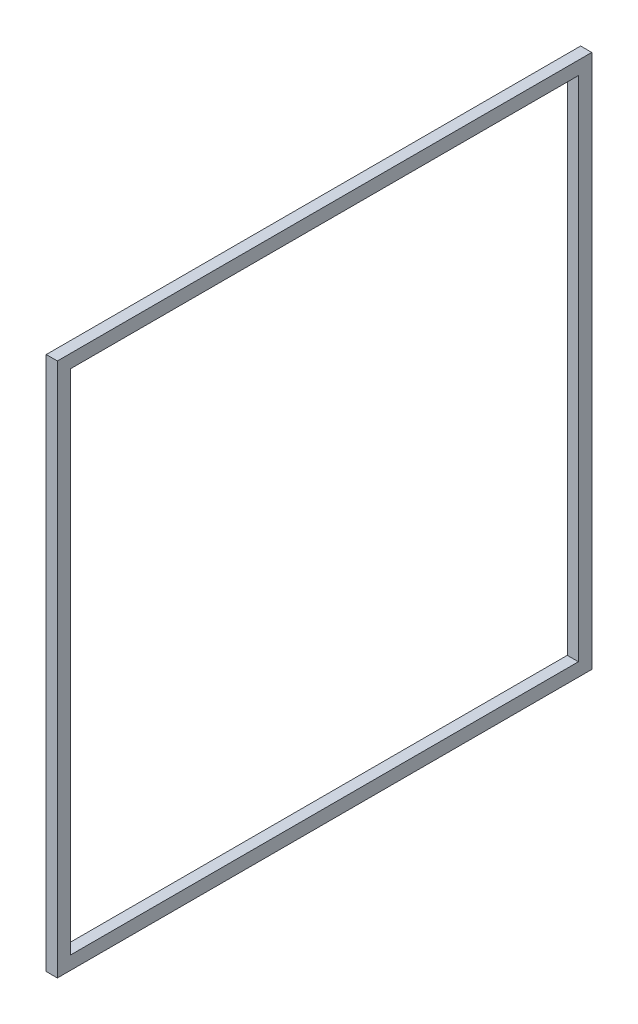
from build123d import *

# Parameters (mm, degrees)
SKETCH1_W             = 304.8
SKETCH1_H             = 304.8
SKETCH1_W_2           = 289.56
SKETCH1_H_2           = 289.56
SCREEN_RETAINER_DEPTH = 6.35


with BuildPart() as part:
    # Sketch1 → Screen_retainer (new body)
    with BuildSketch(Plane.YZ):
        Rectangle(SKETCH1_W, SKETCH1_H)
        Rectangle(SKETCH1_W_2, SKETCH1_H_2, mode=Mode.SUBTRACT)
    extrude(amount=SCREEN_RETAINER_DEPTH)


solid = part.part
